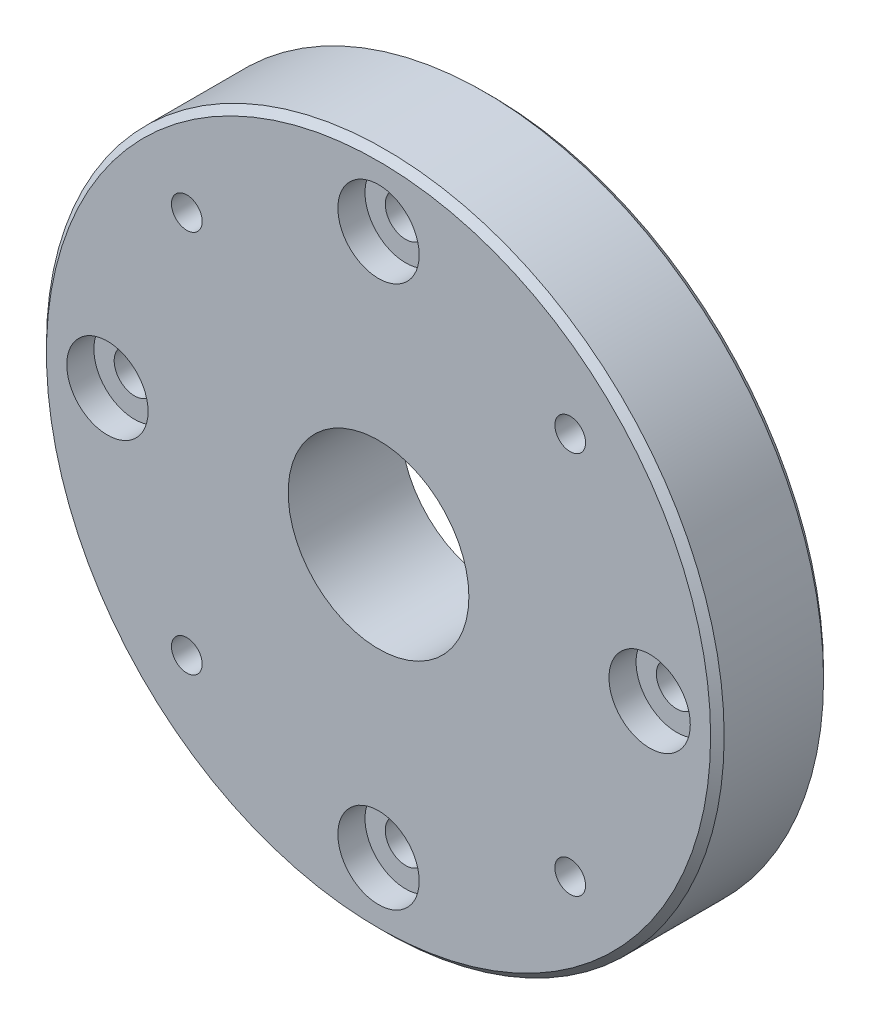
from build123d import *

# Parameters (mm, degrees)
SKIZZE1_R                                            = 75
AUFSATZ_LINEAR_AUSTRAGEN1_DEPTH                      = 25
STIRNSENKUNG_F_R_M8_FLACHKOPFSCHRAUBE_MI_D           = 9
STIRNSENKUNG_F_R_M8_FLACHKOPFSCHRAUBE_MI_CBORE_D     = 18
STIRNSENKUNG_F_R_M8_FLACHKOPFSCHRAUBE_MI_CBORE_DEPTH = 6
M8_GEWINDEBOHRUNG1_D                                 = 6.8
KREISMUSTER1_COUNT                                   = 4
FASE1_SIZE                                           = 1.5
SKIZZE5_R                                            = 20
SCHNITT_LINEAR_AUSTRAGEN1_DEPTH                      = 109.972473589


with BuildPart() as part:
    # Skizze1 → Aufsatz-Linear austragen1 (new body)
    with BuildSketch(Plane.XY):
        Circle(SKIZZE1_R)
    extrude(amount=AUFSATZ_LINEAR_AUSTRAGEN1_DEPTH)

    # Stirnsenkung f_r M8 Flachkopfschraube mi (through all)
    with Locations(Plane(origin=(0, 60, 25), x_dir=(1, 0, 0), z_dir=(0, 0, 1))):
        with Locations((0, 0)):
            stirnsenkung_f_r_m8_flachkopfschraube_mi = CounterBoreHole(STIRNSENKUNG_F_R_M8_FLACHKOPFSCHRAUBE_MI_D / 2, STIRNSENKUNG_F_R_M8_FLACHKOPFSCHRAUBE_MI_CBORE_D / 2, STIRNSENKUNG_F_R_M8_FLACHKOPFSCHRAUBE_MI_CBORE_DEPTH)

    # M8 Gewindebohrung1 (through all)
    with Locations(Plane(origin=(42.426406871, 42.426406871, 25), x_dir=(1, 0, 0), z_dir=(0, 0, 1))):
        with Locations((0, 0)):
            m8_gewindebohrung1 = Hole(M8_GEWINDEBOHRUNG1_D / 2)

    # Kreismuster1: Stirnsenkung f_r M8 Flachkopfschraube mi, M8 Gewindebohrung1 ×4 about axis
    kreismuster1_axis = Axis((0, 0, 0), (0, 0, 1))
    add([stirnsenkung_f_r_m8_flachkopfschraube_mi.rotate(kreismuster1_axis, i * 360 / KREISMUSTER1_COUNT) for i in range(1, KREISMUSTER1_COUNT)], mode=Mode.SUBTRACT)
    add([m8_gewindebohrung1.rotate(kreismuster1_axis, i * 360 / KREISMUSTER1_COUNT) for i in range(1, KREISMUSTER1_COUNT)], mode=Mode.SUBTRACT)

    # Fase1
    fase1_edges = [part.edges().sort_by_distance(p)[0] for p in [
        (-75, 0, 0),
        (-75, 0, 25),
    ]]
    chamfer(fase1_edges, length=FASE1_SIZE)

    # Skizze5 → Schnitt-Linear austragen1 (cut, through all)
    with BuildSketch(Plane.XY.offset(25)):
        Circle(SKIZZE5_R)
    extrude(amount=-SCHNITT_LINEAR_AUSTRAGEN1_DEPTH, mode=Mode.SUBTRACT)


solid = part.part
